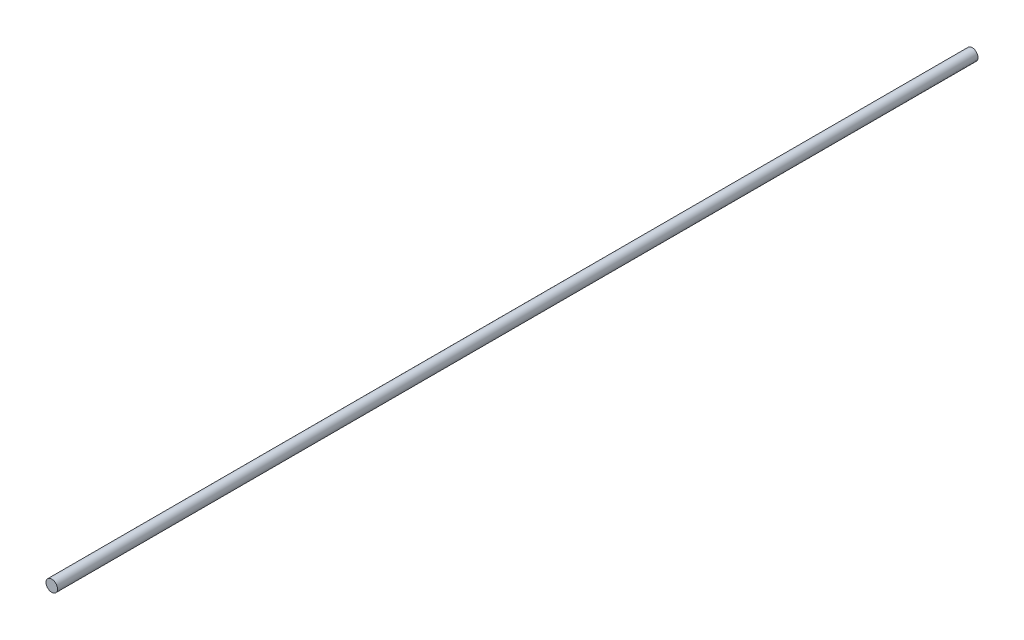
ISO-10303-21;
HEADER;
FILE_DESCRIPTION(('STEP AP214'),'2;1');
FILE_NAME('part.step','',(''),(''),'','','');
FILE_SCHEMA(('AUTOMOTIVE_DESIGN { 1 0 10303 214 1 1 1 1 }'));
ENDSEC;
DATA;
#1=APPLICATION_CONTEXT('core data for automotive mechanical design processes');
#2=APPLICATION_PROTOCOL_DEFINITION('international standard','automotive_design',2000,#1);
#3=PRODUCT_CONTEXT('',#1,'mechanical');
#4=PRODUCT('Part','Part','',(#3));
#5=PRODUCT_RELATED_PRODUCT_CATEGORY('part','',(#4));
#6=PRODUCT_DEFINITION_FORMATION('','',#4);
#7=PRODUCT_DEFINITION_CONTEXT('part definition',#1,'design');
#8=PRODUCT_DEFINITION('design','',#6,#7);
#9=PRODUCT_DEFINITION_SHAPE('','',#8);
#10=(LENGTH_UNIT() NAMED_UNIT(*) SI_UNIT(.MILLI.,.METRE.));
#11=(NAMED_UNIT(*) PLANE_ANGLE_UNIT() SI_UNIT($,.RADIAN.));
#12=(NAMED_UNIT(*) SI_UNIT($,.STERADIAN.) SOLID_ANGLE_UNIT());
#13=UNCERTAINTY_MEASURE_WITH_UNIT(LENGTH_MEASURE(1.E-05),#10,'distance_accuracy_value','');
#14=(GEOMETRIC_REPRESENTATION_CONTEXT(3) GLOBAL_UNCERTAINTY_ASSIGNED_CONTEXT((#13)) GLOBAL_UNIT_ASSIGNED_CONTEXT((#10,
#11,#12)) REPRESENTATION_CONTEXT('',''));
#15=CARTESIAN_POINT('',(0.,0.,0.));
#16=DIRECTION('',(0.,0.,1.));
#17=DIRECTION('',(1.,0.,0.));
#18=AXIS2_PLACEMENT_3D('',#15,#16,#17);
#19=CARTESIAN_POINT('',(0.,0.,-4800.));
#20=DIRECTION('',(0.,0.,1.));
#21=DIRECTION('',(1.,0.,0.));
#22=AXIS2_PLACEMENT_3D('',#19,#20,#21);
#23=CYLINDRICAL_SURFACE('',#22,30.);
#24=CARTESIAN_POINT('',(0.,0.,-4800.));
#25=DIRECTION('',(0.,0.,1.));
#26=DIRECTION('',(1.,0.,0.));
#27=AXIS2_PLACEMENT_3D('',#24,#25,#26);
#28=CIRCLE('',#27,30.);
#29=CARTESIAN_POINT('',(30.,0.,-4800.));
#30=VERTEX_POINT('',#29);
#31=EDGE_CURVE('E10',#30,#30,#28,.T.);
#32=ORIENTED_EDGE('',*,*,#31,.T.);
#33=EDGE_LOOP('',(#32));
#34=FACE_BOUND('',#33,.T.);
#35=CARTESIAN_POINT('',(0.,0.,0.));
#36=DIRECTION('',(0.,0.,1.));
#37=DIRECTION('',(1.,0.,0.));
#38=AXIS2_PLACEMENT_3D('',#35,#36,#37);
#39=CIRCLE('',#38,30.);
#40=CARTESIAN_POINT('',(30.,0.,0.));
#41=VERTEX_POINT('',#40);
#42=EDGE_CURVE('E40',#41,#41,#39,.T.);
#43=ORIENTED_EDGE('',*,*,#42,.F.);
#44=EDGE_LOOP('',(#43));
#45=FACE_BOUND('',#44,.T.);
#46=ADVANCED_FACE('F37',(#34,#45),#23,.T.);
#47=CARTESIAN_POINT('',(0.,0.,-4800.));
#48=DIRECTION('',(0.,0.,1.));
#49=DIRECTION('',(1.,0.,0.));
#50=AXIS2_PLACEMENT_3D('',#47,#48,#49);
#51=PLANE('',#50);
#52=ORIENTED_EDGE('',*,*,#31,.F.);
#53=EDGE_LOOP('',(#52));
#54=FACE_BOUND('',#53,.T.);
#55=ADVANCED_FACE('F54',(#54),#51,.F.);
#56=CARTESIAN_POINT('',(0.,0.,0.));
#57=DIRECTION('',(0.,0.,1.));
#58=DIRECTION('',(1.,0.,0.));
#59=AXIS2_PLACEMENT_3D('',#56,#57,#58);
#60=PLANE('',#59);
#61=ORIENTED_EDGE('',*,*,#42,.T.);
#62=EDGE_LOOP('',(#61));
#63=FACE_BOUND('',#62,.T.);
#64=ADVANCED_FACE('F51',(#63),#60,.T.);
#65=CLOSED_SHELL('',(#46,#55,#64));
#66=MANIFOLD_SOLID_BREP('B2',#65);
#67=ADVANCED_BREP_SHAPE_REPRESENTATION('',(#18,#66),#14);
#68=SHAPE_DEFINITION_REPRESENTATION(#9,#67);
ENDSEC;
END-ISO-10303-21;
